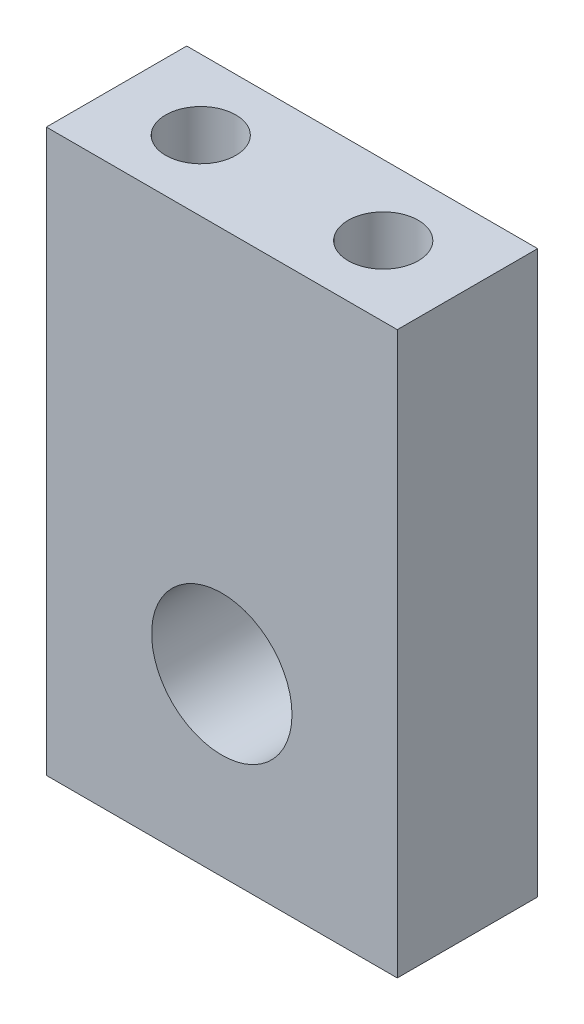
from build123d import *

# Parameters (mm, degrees)
ESQUISSE1_W               = 25
ESQUISSE1_H               = 40
BOSS_EXTRU_1_DEPTH        = 10
ESQUISSE2_R               = 5
ENL_V_MAT_EXTRU_1_DEPTH   = 10
TROU_TARAUD_M6X1_01_D     = 5
TROU_TARAUD_M6X1_01_DEPTH = 17
TROU_TARAUD_M6X1_01_TIP   = 1.502151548


with BuildPart() as part:
    # Esquisse1 → Boss.-Extru.1 (new body)
    with BuildSketch(Plane.XY):
        Rectangle(ESQUISSE1_W, ESQUISSE1_H)
    extrude(amount=BOSS_EXTRU_1_DEPTH)

    # Esquisse2 → Enl_v. mat.-Extru.1 (cut)
    with BuildSketch(Plane.XY.offset(10)):
        with Locations((0, -7.5)):
            Circle(ESQUISSE2_R)
    extrude(amount=-ENL_V_MAT_EXTRU_1_DEPTH, mode=Mode.SUBTRACT)

    # Trou taraud_ M6x1.01
    with Locations(Plane(origin=(0, 20, 0), x_dir=(1, 0, 0), z_dir=(0, 1, 0))):
        with Locations((-6.5, -5), (6.5, -5)):
            Hole(TROU_TARAUD_M6X1_01_D / 2, depth=TROU_TARAUD_M6X1_01_DEPTH)
            with Locations((0, 0, -(TROU_TARAUD_M6X1_01_DEPTH + TROU_TARAUD_M6X1_01_TIP / 2))):  # 118° drill point
                Cone(0, TROU_TARAUD_M6X1_01_D / 2, TROU_TARAUD_M6X1_01_TIP, mode=Mode.SUBTRACT)


solid = part.part
